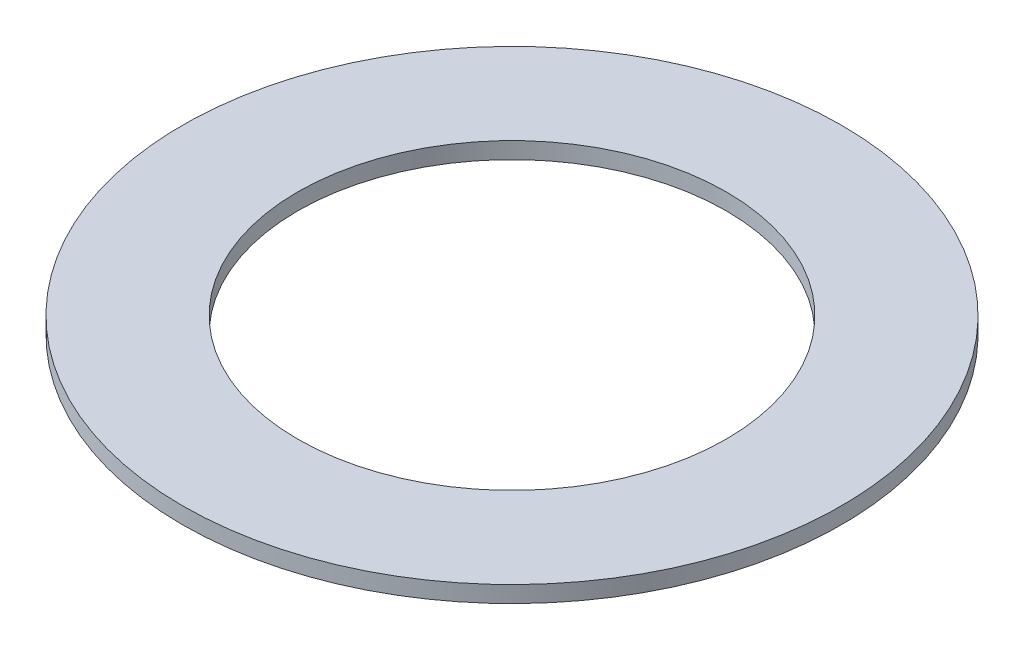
from build123d import *

# Parameters (mm, degrees)
SKETCH1_W = 3.5
SKETCH1_H = 0.5


with BuildPart() as part:
    # Sketch1 → Base-Revolve (revolve)
    with BuildSketch(Plane.XY, mode=Mode.PRIVATE) as base_revolve_sk:
        with Locations((8.25, 0.25)):
            Rectangle(SKETCH1_W, SKETCH1_H)
    revolve(base_revolve_sk.sketch.rotate(Axis((0, 0, 0), (0, 1, 0)), 90), axis=Axis((0, 0, 0), (0, 1, 0)))


solid = part.part
